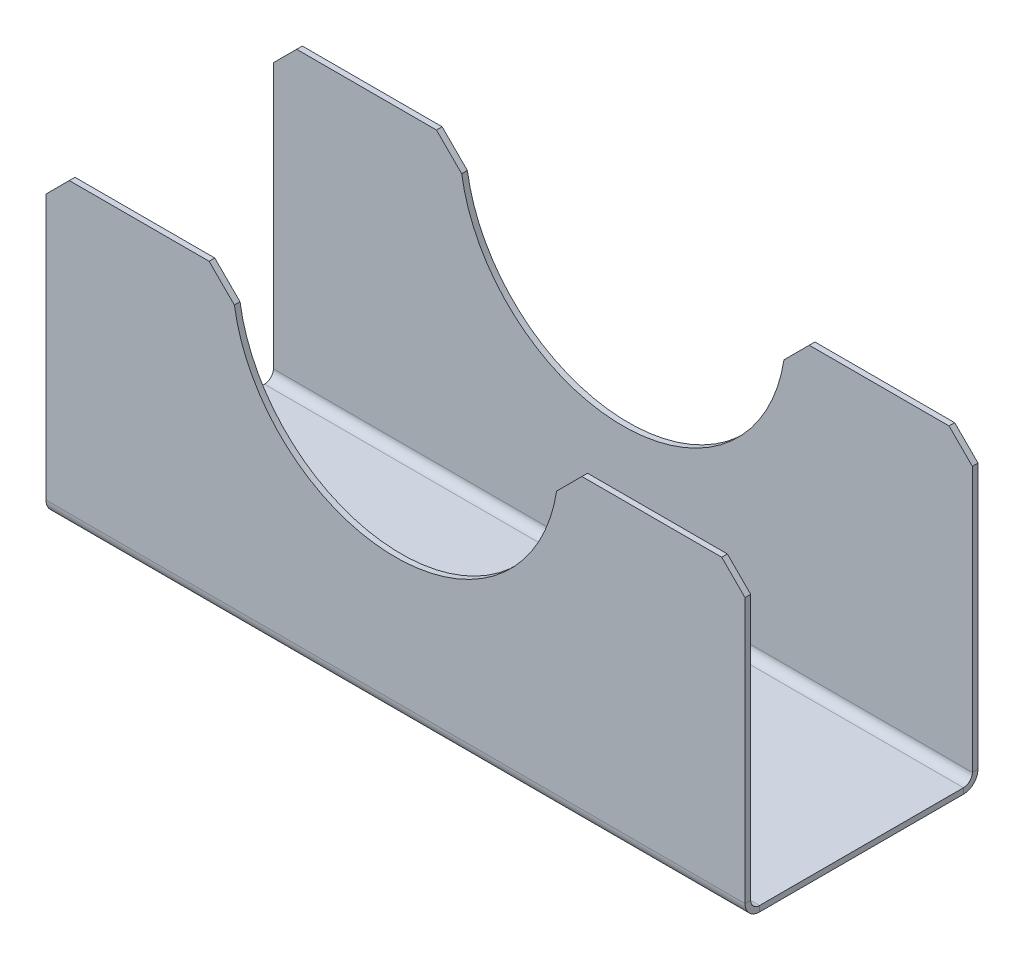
ISO-10303-21;
HEADER;
FILE_DESCRIPTION(('STEP AP214'),'2;1');
FILE_NAME('part.step','',(''),(''),'','','');
FILE_SCHEMA(('AUTOMOTIVE_DESIGN { 1 0 10303 214 1 1 1 1 }'));
ENDSEC;
DATA;
#1=APPLICATION_CONTEXT('core data for automotive mechanical design processes');
#2=APPLICATION_PROTOCOL_DEFINITION('international standard','automotive_design',2000,#1);
#3=PRODUCT_CONTEXT('',#1,'mechanical');
#4=PRODUCT('Part','Part','',(#3));
#5=PRODUCT_RELATED_PRODUCT_CATEGORY('part','',(#4));
#6=PRODUCT_DEFINITION_FORMATION('','',#4);
#7=PRODUCT_DEFINITION_CONTEXT('part definition',#1,'design');
#8=PRODUCT_DEFINITION('design','',#6,#7);
#9=PRODUCT_DEFINITION_SHAPE('','',#8);
#10=(LENGTH_UNIT() NAMED_UNIT(*) SI_UNIT(.MILLI.,.METRE.));
#11=(NAMED_UNIT(*) PLANE_ANGLE_UNIT() SI_UNIT($,.RADIAN.));
#12=(NAMED_UNIT(*) SI_UNIT($,.STERADIAN.) SOLID_ANGLE_UNIT());
#13=UNCERTAINTY_MEASURE_WITH_UNIT(LENGTH_MEASURE(1.E-05),#10,'distance_accuracy_value','');
#14=(GEOMETRIC_REPRESENTATION_CONTEXT(3) GLOBAL_UNCERTAINTY_ASSIGNED_CONTEXT((#13)) GLOBAL_UNIT_ASSIGNED_CONTEXT((#10,
#11,#12)) REPRESENTATION_CONTEXT('',''));
#15=CARTESIAN_POINT('',(0.,0.,0.));
#16=DIRECTION('',(0.,0.,1.));
#17=DIRECTION('',(1.,0.,0.));
#18=AXIS2_PLACEMENT_3D('',#15,#16,#17);
#19=CARTESIAN_POINT('',(75.,-65.,50.));
#20=DIRECTION('',(1.,0.,0.));
#21=DIRECTION('',(0.,0.,-1.));
#22=AXIS2_PLACEMENT_3D('',#19,#20,#21);
#23=PLANE('',#22);
#24=DIRECTION('',(0.,-1.,0.));
#25=VECTOR('',#24,1.);
#26=CARTESIAN_POINT('',(75.,-65.,3.11912));
#27=LINE('',#26,#25);
#28=CARTESIAN_POINT('',(75.,-63.78588,3.11912));
#29=VERTEX_POINT('',#28);
#30=CARTESIAN_POINT('',(75.,-65.,3.11912));
#31=VERTEX_POINT('',#30);
#32=EDGE_CURVE('E11',#29,#31,#27,.T.);
#33=ORIENTED_EDGE('',*,*,#32,.F.);
#34=DIRECTION('',(0.,0.,1.));
#35=VECTOR('',#34,1.);
#36=CARTESIAN_POINT('',(75.,-63.78588,50.));
#37=LINE('',#36,#35);
#38=CARTESIAN_POINT('',(75.,-63.78588,46.88088));
#39=VERTEX_POINT('',#38);
#40=EDGE_CURVE('E127',#39,#29,#37,.F.);
#41=ORIENTED_EDGE('',*,*,#40,.F.);
#42=DIRECTION('',(0.,-1.,0.));
#43=VECTOR('',#42,1.);
#44=CARTESIAN_POINT('',(75.,-65.,46.88088));
#45=LINE('',#44,#43);
#46=CARTESIAN_POINT('',(75.,-65.,46.88088));
#47=VERTEX_POINT('',#46);
#48=EDGE_CURVE('E44',#39,#47,#45,.T.);
#49=ORIENTED_EDGE('',*,*,#48,.T.);
#50=DIRECTION('',(0.,0.,-1.));
#51=VECTOR('',#50,1.);
#52=CARTESIAN_POINT('',(75.,-65.,50.));
#53=LINE('',#52,#51);
#54=EDGE_CURVE('E129',#47,#31,#53,.T.);
#55=ORIENTED_EDGE('',*,*,#54,.T.);
#56=EDGE_LOOP('',(#33,#41,#49,#55));
#57=FACE_BOUND('',#56,.T.);
#58=ADVANCED_FACE('F34',(#57),#23,.T.);
#59=CARTESIAN_POINT('',(75.,-61.88088,46.88088));
#60=DIRECTION('',(1.,0.,0.));
#61=DIRECTION('',(0.,0.,-1.));
#62=AXIS2_PLACEMENT_3D('',#59,#60,#61);
#63=PLANE('',#62);
#64=ORIENTED_EDGE('',*,*,#48,.F.);
#65=CARTESIAN_POINT('',(75.,-61.88088,46.88088));
#66=DIRECTION('',(-1.,0.,0.));
#67=DIRECTION('',(0.,-1.,0.));
#68=AXIS2_PLACEMENT_3D('',#65,#66,#67);
#69=CIRCLE('',#68,1.905);
#70=CARTESIAN_POINT('',(75.,-61.88088,48.78588));
#71=VERTEX_POINT('',#70);
#72=EDGE_CURVE('E168',#39,#71,#69,.T.);
#73=ORIENTED_EDGE('',*,*,#72,.T.);
#74=DIRECTION('',(0.,0.,1.));
#75=VECTOR('',#74,1.);
#76=CARTESIAN_POINT('',(75.,-61.88088,50.));
#77=LINE('',#76,#75);
#78=CARTESIAN_POINT('',(75.,-61.88088,50.));
#79=VERTEX_POINT('',#78);
#80=EDGE_CURVE('E231',#71,#79,#77,.T.);
#81=ORIENTED_EDGE('',*,*,#80,.T.);
#82=CARTESIAN_POINT('',(75.,-61.88088,46.88088));
#83=DIRECTION('',(-1.,0.,0.));
#84=DIRECTION('',(0.,0.,1.));
#85=AXIS2_PLACEMENT_3D('',#82,#83,#84);
#86=CIRCLE('',#85,3.11912);
#87=EDGE_CURVE('E240',#47,#79,#86,.T.);
#88=ORIENTED_EDGE('',*,*,#87,.F.);
#89=EDGE_LOOP('',(#64,#73,#81,#88));
#90=FACE_BOUND('',#89,.T.);
#91=ADVANCED_FACE('F239',(#90),#63,.T.);
#92=CARTESIAN_POINT('',(75.,-65.,50.));
#93=DIRECTION('',(1.,0.,0.));
#94=DIRECTION('',(0.,1.,0.));
#95=AXIS2_PLACEMENT_3D('',#92,#93,#94);
#96=PLANE('',#95);
#97=ORIENTED_EDGE('',*,*,#80,.F.);
#98=DIRECTION('',(0.,1.,0.));
#99=VECTOR('',#98,1.);
#100=CARTESIAN_POINT('',(75.,0.,48.78588));
#101=LINE('',#100,#99);
#102=CARTESIAN_POINT('',(75.,-4.99999999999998,48.78588));
#103=VERTEX_POINT('',#102);
#104=EDGE_CURVE('E165',#71,#103,#101,.T.);
#105=ORIENTED_EDGE('',*,*,#104,.T.);
#106=DIRECTION('',(0.,0.,1.));
#107=VECTOR('',#106,1.);
#108=CARTESIAN_POINT('',(75.,-4.99999999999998,50.));
#109=LINE('',#108,#107);
#110=CARTESIAN_POINT('',(75.,-4.99999999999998,50.));
#111=VERTEX_POINT('',#110);
#112=EDGE_CURVE('E228',#103,#111,#109,.T.);
#113=ORIENTED_EDGE('',*,*,#112,.T.);
#114=DIRECTION('',(0.,1.,0.));
#115=VECTOR('',#114,1.);
#116=CARTESIAN_POINT('',(75.,-65.,50.));
#117=LINE('',#116,#115);
#118=EDGE_CURVE('E259',#79,#111,#117,.T.);
#119=ORIENTED_EDGE('',*,*,#118,.F.);
#120=EDGE_LOOP('',(#97,#105,#113,#119));
#121=FACE_BOUND('',#120,.T.);
#122=ADVANCED_FACE('F260',(#121),#96,.T.);
#123=CARTESIAN_POINT('',(35.0000000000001,35.,50.));
#124=DIRECTION('',(-0.707106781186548,-0.707106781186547,0.));
#125=DIRECTION('',(0.707106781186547,-0.707106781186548,0.));
#126=AXIS2_PLACEMENT_3D('',#123,#124,#125);
#127=PLANE('',#126);
#128=ORIENTED_EDGE('',*,*,#112,.F.);
#129=DIRECTION('',(0.707106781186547,-0.707106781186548,0.));
#130=VECTOR('',#129,1.);
#131=CARTESIAN_POINT('',(35.0000000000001,35.,48.78588));
#132=LINE('',#131,#130);
#133=CARTESIAN_POINT('',(70.0000000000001,0.,48.78588));
#134=VERTEX_POINT('',#133);
#135=EDGE_CURVE('E335',#103,#134,#132,.F.);
#136=ORIENTED_EDGE('',*,*,#135,.T.);
#137=DIRECTION('',(0.,0.,1.));
#138=VECTOR('',#137,1.);
#139=CARTESIAN_POINT('',(70.0000000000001,0.,50.));
#140=LINE('',#139,#138);
#141=CARTESIAN_POINT('',(70.0000000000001,0.,50.));
#142=VERTEX_POINT('',#141);
#143=EDGE_CURVE('E225',#134,#142,#140,.T.);
#144=ORIENTED_EDGE('',*,*,#143,.T.);
#145=DIRECTION('',(0.707106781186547,-0.707106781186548,0.));
#146=VECTOR('',#145,1.);
#147=CARTESIAN_POINT('',(35.0000000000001,35.,50.));
#148=LINE('',#147,#146);
#149=EDGE_CURVE('E264',#111,#142,#148,.F.);
#150=ORIENTED_EDGE('',*,*,#149,.F.);
#151=EDGE_LOOP('',(#128,#136,#144,#150));
#152=FACE_BOUND('',#151,.T.);
#153=ADVANCED_FACE('F348',(#152),#127,.F.);
#154=CARTESIAN_POINT('',(75.,0.,50.));
#155=DIRECTION('',(0.,1.,0.));
#156=DIRECTION('',(-1.,0.,0.));
#157=AXIS2_PLACEMENT_3D('',#154,#155,#156);
#158=PLANE('',#157);
#159=ORIENTED_EDGE('',*,*,#143,.F.);
#160=DIRECTION('',(1.,0.,0.));
#161=VECTOR('',#160,1.);
#162=CARTESIAN_POINT('',(0.,0.,48.78588));
#163=LINE('',#162,#161);
#164=CARTESIAN_POINT('',(40.,0.,48.78588));
#165=VERTEX_POINT('',#164);
#166=EDGE_CURVE('E332',#134,#165,#163,.F.);
#167=ORIENTED_EDGE('',*,*,#166,.T.);
#168=DIRECTION('',(0.,0.,1.));
#169=VECTOR('',#168,1.);
#170=CARTESIAN_POINT('',(40.,0.,50.));
#171=LINE('',#170,#169);
#172=CARTESIAN_POINT('',(40.,0.,50.));
#173=VERTEX_POINT('',#172);
#174=EDGE_CURVE('E222',#165,#173,#171,.T.);
#175=ORIENTED_EDGE('',*,*,#174,.T.);
#176=DIRECTION('',(-1.,0.,0.));
#177=VECTOR('',#176,1.);
#178=CARTESIAN_POINT('',(75.,0.,50.));
#179=LINE('',#178,#177);
#180=EDGE_CURVE('E353',#142,#173,#179,.T.);
#181=ORIENTED_EDGE('',*,*,#180,.F.);
#182=EDGE_LOOP('',(#159,#167,#175,#181));
#183=FACE_BOUND('',#182,.T.);
#184=ADVANCED_FACE('F474',(#183),#158,.T.);
#185=CARTESIAN_POINT('',(19.9999999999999,-20.,50.));
#186=DIRECTION('',(0.707106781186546,-0.707106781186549,0.));
#187=DIRECTION('',(0.707106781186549,0.707106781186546,0.));
#188=AXIS2_PLACEMENT_3D('',#185,#186,#187);
#189=PLANE('',#188);
#190=ORIENTED_EDGE('',*,*,#174,.F.);
#191=DIRECTION('',(0.707106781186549,0.707106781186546,0.));
#192=VECTOR('',#191,1.);
#193=CARTESIAN_POINT('',(19.9999999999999,-20.,48.78588));
#194=LINE('',#193,#192);
#195=CARTESIAN_POINT('',(34.5773797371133,-5.42262026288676,48.78588));
#196=VERTEX_POINT('',#195);
#197=EDGE_CURVE('E329',#165,#196,#194,.F.);
#198=ORIENTED_EDGE('',*,*,#197,.T.);
#199=DIRECTION('',(0.,0.,1.));
#200=VECTOR('',#199,1.);
#201=CARTESIAN_POINT('',(34.5773797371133,-5.42262026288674,50.));
#202=LINE('',#201,#200);
#203=CARTESIAN_POINT('',(34.5773797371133,-5.42262026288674,50.));
#204=VERTEX_POINT('',#203);
#205=EDGE_CURVE('E219',#196,#204,#202,.T.);
#206=ORIENTED_EDGE('',*,*,#205,.T.);
#207=DIRECTION('',(0.707106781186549,0.707106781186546,0.));
#208=VECTOR('',#207,1.);
#209=CARTESIAN_POINT('',(19.9999999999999,-20.,50.));
#210=LINE('',#209,#208);
#211=EDGE_CURVE('E355',#173,#204,#210,.F.);
#212=ORIENTED_EDGE('',*,*,#211,.F.);
#213=EDGE_LOOP('',(#190,#198,#206,#212));
#214=FACE_BOUND('',#213,.T.);
#215=ADVANCED_FACE('F477',(#214),#189,.F.);
#216=CARTESIAN_POINT('',(0.,0.,50.));
#217=DIRECTION('',(0.,0.,1.));
#218=DIRECTION('',(1.,0.,0.));
#219=AXIS2_PLACEMENT_3D('',#216,#217,#218);
#220=CYLINDRICAL_SURFACE('',#219,35.);
#221=ORIENTED_EDGE('',*,*,#205,.F.);
#222=CARTESIAN_POINT('',(0.,0.,48.78588));
#223=DIRECTION('',(0.,0.,-1.));
#224=DIRECTION('',(-1.,0.,0.));
#225=AXIS2_PLACEMENT_3D('',#222,#223,#224);
#226=CIRCLE('',#225,35.);
#227=CARTESIAN_POINT('',(-34.5773797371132,-5.42262026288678,48.78588));
#228=VERTEX_POINT('',#227);
#229=EDGE_CURVE('E326',#196,#228,#226,.T.);
#230=ORIENTED_EDGE('',*,*,#229,.T.);
#231=DIRECTION('',(0.,0.,1.));
#232=VECTOR('',#231,1.);
#233=CARTESIAN_POINT('',(-34.5773797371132,-5.42262026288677,50.));
#234=LINE('',#233,#232);
#235=CARTESIAN_POINT('',(-34.5773797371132,-5.42262026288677,50.));
#236=VERTEX_POINT('',#235);
#237=EDGE_CURVE('E216',#228,#236,#234,.T.);
#238=ORIENTED_EDGE('',*,*,#237,.T.);
#239=CARTESIAN_POINT('',(0.,0.,50.));
#240=DIRECTION('',(0.,0.,-1.));
#241=DIRECTION('',(1.,0.,0.));
#242=AXIS2_PLACEMENT_3D('',#239,#240,#241);
#243=CIRCLE('',#242,35.);
#244=EDGE_CURVE('E360',#204,#236,#243,.T.);
#245=ORIENTED_EDGE('',*,*,#244,.F.);
#246=EDGE_LOOP('',(#221,#230,#238,#245));
#247=FACE_BOUND('',#246,.T.);
#248=ADVANCED_FACE('F481',(#247),#220,.F.);
#249=CARTESIAN_POINT('',(-20.0000000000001,-20.,50.));
#250=DIRECTION('',(-0.70710678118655,-0.707106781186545,0.));
#251=DIRECTION('',(0.707106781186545,-0.70710678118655,0.));
#252=AXIS2_PLACEMENT_3D('',#249,#250,#251);
#253=PLANE('',#252);
#254=ORIENTED_EDGE('',*,*,#237,.F.);
#255=DIRECTION('',(0.707106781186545,-0.70710678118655,0.));
#256=VECTOR('',#255,1.);
#257=CARTESIAN_POINT('',(-20.0000000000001,-20.,48.78588));
#258=LINE('',#257,#256);
#259=CARTESIAN_POINT('',(-40.,0.,48.78588));
#260=VERTEX_POINT('',#259);
#261=EDGE_CURVE('E323',#228,#260,#258,.F.);
#262=ORIENTED_EDGE('',*,*,#261,.T.);
#263=DIRECTION('',(0.,0.,1.));
#264=VECTOR('',#263,1.);
#265=CARTESIAN_POINT('',(-40.,0.,50.));
#266=LINE('',#265,#264);
#267=CARTESIAN_POINT('',(-40.,0.,50.));
#268=VERTEX_POINT('',#267);
#269=EDGE_CURVE('E213',#260,#268,#266,.T.);
#270=ORIENTED_EDGE('',*,*,#269,.T.);
#271=DIRECTION('',(0.707106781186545,-0.70710678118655,0.));
#272=VECTOR('',#271,1.);
#273=CARTESIAN_POINT('',(-20.0000000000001,-20.,50.));
#274=LINE('',#273,#272);
#275=EDGE_CURVE('E363',#236,#268,#274,.F.);
#276=ORIENTED_EDGE('',*,*,#275,.F.);
#277=EDGE_LOOP('',(#254,#262,#270,#276));
#278=FACE_BOUND('',#277,.T.);
#279=ADVANCED_FACE('F485',(#278),#253,.F.);
#280=CARTESIAN_POINT('',(-35.,0.,50.));
#281=DIRECTION('',(0.,1.,0.));
#282=DIRECTION('',(-1.,0.,0.));
#283=AXIS2_PLACEMENT_3D('',#280,#281,#282);
#284=PLANE('',#283);
#285=ORIENTED_EDGE('',*,*,#269,.F.);
#286=DIRECTION('',(1.,0.,0.));
#287=VECTOR('',#286,1.);
#288=CARTESIAN_POINT('',(0.,0.,48.78588));
#289=LINE('',#288,#287);
#290=CARTESIAN_POINT('',(-69.9999999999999,0.,48.78588));
#291=VERTEX_POINT('',#290);
#292=EDGE_CURVE('E320',#260,#291,#289,.F.);
#293=ORIENTED_EDGE('',*,*,#292,.T.);
#294=DIRECTION('',(0.,0.,1.));
#295=VECTOR('',#294,1.);
#296=CARTESIAN_POINT('',(-69.9999999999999,0.,50.));
#297=LINE('',#296,#295);
#298=CARTESIAN_POINT('',(-69.9999999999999,0.,50.));
#299=VERTEX_POINT('',#298);
#300=EDGE_CURVE('E210',#291,#299,#297,.T.);
#301=ORIENTED_EDGE('',*,*,#300,.T.);
#302=DIRECTION('',(-1.,0.,0.));
#303=VECTOR('',#302,1.);
#304=CARTESIAN_POINT('',(-35.,0.,50.));
#305=LINE('',#304,#303);
#306=EDGE_CURVE('E366',#268,#299,#305,.T.);
#307=ORIENTED_EDGE('',*,*,#306,.F.);
#308=EDGE_LOOP('',(#285,#293,#301,#307));
#309=FACE_BOUND('',#308,.T.);
#310=ADVANCED_FACE('F489',(#309),#284,.T.);
#311=CARTESIAN_POINT('',(-35.,35.,50.));
#312=DIRECTION('',(0.707106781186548,-0.707106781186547,0.));
#313=DIRECTION('',(0.707106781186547,0.707106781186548,0.));
#314=AXIS2_PLACEMENT_3D('',#311,#312,#313);
#315=PLANE('',#314);
#316=ORIENTED_EDGE('',*,*,#300,.F.);
#317=DIRECTION('',(0.707106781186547,0.707106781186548,0.));
#318=VECTOR('',#317,1.);
#319=CARTESIAN_POINT('',(-35.,35.,48.78588));
#320=LINE('',#319,#318);
#321=CARTESIAN_POINT('',(-75.,-5.00000000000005,48.78588));
#322=VERTEX_POINT('',#321);
#323=EDGE_CURVE('E317',#291,#322,#320,.F.);
#324=ORIENTED_EDGE('',*,*,#323,.T.);
#325=DIRECTION('',(0.,0.,1.));
#326=VECTOR('',#325,1.);
#327=CARTESIAN_POINT('',(-75.,-5.00000000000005,50.));
#328=LINE('',#327,#326);
#329=CARTESIAN_POINT('',(-75.,-5.00000000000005,50.));
#330=VERTEX_POINT('',#329);
#331=EDGE_CURVE('E207',#322,#330,#328,.T.);
#332=ORIENTED_EDGE('',*,*,#331,.T.);
#333=DIRECTION('',(0.707106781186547,0.707106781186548,0.));
#334=VECTOR('',#333,1.);
#335=CARTESIAN_POINT('',(-35.,35.,50.));
#336=LINE('',#335,#334);
#337=EDGE_CURVE('E369',#299,#330,#336,.F.);
#338=ORIENTED_EDGE('',*,*,#337,.F.);
#339=EDGE_LOOP('',(#316,#324,#332,#338));
#340=FACE_BOUND('',#339,.T.);
#341=ADVANCED_FACE('F493',(#340),#315,.F.);
#342=CARTESIAN_POINT('',(-75.,0.,50.));
#343=DIRECTION('',(-1.,0.,0.));
#344=DIRECTION('',(0.,-1.,0.));
#345=AXIS2_PLACEMENT_3D('',#342,#343,#344);
#346=PLANE('',#345);
#347=ORIENTED_EDGE('',*,*,#331,.F.);
#348=DIRECTION('',(0.,1.,0.));
#349=VECTOR('',#348,1.);
#350=CARTESIAN_POINT('',(-75.,0.,48.78588));
#351=LINE('',#350,#349);
#352=CARTESIAN_POINT('',(-75.,-61.88088,48.78588));
#353=VERTEX_POINT('',#352);
#354=EDGE_CURVE('E158',#322,#353,#351,.F.);
#355=ORIENTED_EDGE('',*,*,#354,.T.);
#356=DIRECTION('',(0.,0.,1.));
#357=VECTOR('',#356,1.);
#358=CARTESIAN_POINT('',(-75.,-61.88088,50.));
#359=LINE('',#358,#357);
#360=CARTESIAN_POINT('',(-75.,-61.88088,50.));
#361=VERTEX_POINT('',#360);
#362=EDGE_CURVE('E204',#353,#361,#359,.T.);
#363=ORIENTED_EDGE('',*,*,#362,.T.);
#364=DIRECTION('',(0.,-1.,0.));
#365=VECTOR('',#364,1.);
#366=CARTESIAN_POINT('',(-75.,0.,50.));
#367=LINE('',#366,#365);
#368=EDGE_CURVE('E271',#330,#361,#367,.T.);
#369=ORIENTED_EDGE('',*,*,#368,.F.);
#370=EDGE_LOOP('',(#347,#355,#363,#369));
#371=FACE_BOUND('',#370,.T.);
#372=ADVANCED_FACE('F448',(#371),#346,.T.);
#373=CARTESIAN_POINT('',(-75.,-61.88088,46.88088));
#374=DIRECTION('',(1.,0.,0.));
#375=DIRECTION('',(0.,1.,0.));
#376=AXIS2_PLACEMENT_3D('',#373,#374,#375);
#377=PLANE('',#376);
#378=ORIENTED_EDGE('',*,*,#362,.F.);
#379=CARTESIAN_POINT('',(-75.,-61.88088,46.88088));
#380=DIRECTION('',(-1.,0.,0.));
#381=DIRECTION('',(0.,-1.,0.));
#382=AXIS2_PLACEMENT_3D('',#379,#380,#381);
#383=CIRCLE('',#382,1.905);
#384=CARTESIAN_POINT('',(-75.,-63.78588,46.88088));
#385=VERTEX_POINT('',#384);
#386=EDGE_CURVE('E163',#353,#385,#383,.F.);
#387=ORIENTED_EDGE('',*,*,#386,.T.);
#388=DIRECTION('',(0.,-1.,0.));
#389=VECTOR('',#388,1.);
#390=CARTESIAN_POINT('',(-75.,-65.,46.88088));
#391=LINE('',#390,#389);
#392=CARTESIAN_POINT('',(-75.,-65.,46.88088));
#393=VERTEX_POINT('',#392);
#394=EDGE_CURVE('E202',#385,#393,#391,.T.);
#395=ORIENTED_EDGE('',*,*,#394,.T.);
#396=CARTESIAN_POINT('',(-75.,-61.88088,46.88088));
#397=DIRECTION('',(-1.,0.,0.));
#398=DIRECTION('',(0.,-1.,0.));
#399=AXIS2_PLACEMENT_3D('',#396,#397,#398);
#400=CIRCLE('',#399,3.11912);
#401=EDGE_CURVE('E256',#361,#393,#400,.F.);
#402=ORIENTED_EDGE('',*,*,#401,.F.);
#403=EDGE_LOOP('',(#378,#387,#395,#402));
#404=FACE_BOUND('',#403,.T.);
#405=ADVANCED_FACE('F450',(#404),#377,.F.);
#406=CARTESIAN_POINT('',(-75.,-65.,50.));
#407=DIRECTION('',(1.,0.,0.));
#408=DIRECTION('',(0.,0.,-1.));
#409=AXIS2_PLACEMENT_3D('',#406,#407,#408);
#410=PLANE('',#409);
#411=ORIENTED_EDGE('',*,*,#394,.F.);
#412=DIRECTION('',(0.,0.,1.));
#413=VECTOR('',#412,1.);
#414=CARTESIAN_POINT('',(-75.,-63.78588,50.));
#415=LINE('',#414,#413);
#416=CARTESIAN_POINT('',(-75.,-63.78588,3.11912));
#417=VERTEX_POINT('',#416);
#418=EDGE_CURVE('E157',#385,#417,#415,.F.);
#419=ORIENTED_EDGE('',*,*,#418,.T.);
#420=DIRECTION('',(0.,-1.,0.));
#421=VECTOR('',#420,1.);
#422=CARTESIAN_POINT('',(-75.,-65.,3.11912));
#423=LINE('',#422,#421);
#424=CARTESIAN_POINT('',(-75.,-65.,3.11912));
#425=VERTEX_POINT('',#424);
#426=EDGE_CURVE('E199',#417,#425,#423,.T.);
#427=ORIENTED_EDGE('',*,*,#426,.T.);
#428=DIRECTION('',(0.,0.,-1.));
#429=VECTOR('',#428,1.);
#430=CARTESIAN_POINT('',(-75.,-65.,50.));
#431=LINE('',#430,#429);
#432=EDGE_CURVE('E373',#393,#425,#431,.T.);
#433=ORIENTED_EDGE('',*,*,#432,.F.);
#434=EDGE_LOOP('',(#411,#419,#427,#433));
#435=FACE_BOUND('',#434,.T.);
#436=ADVANCED_FACE('F453',(#435),#410,.F.);
#437=CARTESIAN_POINT('',(-75.,-61.88088,3.11912));
#438=DIRECTION('',(-1.,0.,0.));
#439=DIRECTION('',(0.,-1.,0.));
#440=AXIS2_PLACEMENT_3D('',#437,#438,#439);
#441=PLANE('',#440);
#442=ORIENTED_EDGE('',*,*,#426,.F.);
#443=CARTESIAN_POINT('',(-75.,-61.88088,3.11912));
#444=DIRECTION('',(1.,0.,0.));
#445=DIRECTION('',(0.,1.,0.));
#446=AXIS2_PLACEMENT_3D('',#443,#444,#445);
#447=CIRCLE('',#446,1.905);
#448=CARTESIAN_POINT('',(-75.,-61.88088,1.21412));
#449=VERTEX_POINT('',#448);
#450=EDGE_CURVE('E145',#417,#449,#447,.T.);
#451=ORIENTED_EDGE('',*,*,#450,.T.);
#452=DIRECTION('',(0.,0.,-1.));
#453=VECTOR('',#452,1.);
#454=CARTESIAN_POINT('',(-75.,-61.88088,0.));
#455=LINE('',#454,#453);
#456=CARTESIAN_POINT('',(-75.,-61.88088,0.));
#457=VERTEX_POINT('',#456);
#458=EDGE_CURVE('E196',#449,#457,#455,.T.);
#459=ORIENTED_EDGE('',*,*,#458,.T.);
#460=CARTESIAN_POINT('',(-75.,-61.88088,3.11912));
#461=DIRECTION('',(1.,0.,0.));
#462=DIRECTION('',(0.,1.,0.));
#463=AXIS2_PLACEMENT_3D('',#460,#461,#462);
#464=CIRCLE('',#463,3.11912);
#465=EDGE_CURVE('E265',#425,#457,#464,.T.);
#466=ORIENTED_EDGE('',*,*,#465,.F.);
#467=EDGE_LOOP('',(#442,#451,#459,#466));
#468=FACE_BOUND('',#467,.T.);
#469=ADVANCED_FACE('F504',(#468),#441,.T.);
#470=CARTESIAN_POINT('',(-75.,0.,0.));
#471=DIRECTION('',(-1.,0.,0.));
#472=DIRECTION('',(0.,-1.,0.));
#473=AXIS2_PLACEMENT_3D('',#470,#471,#472);
#474=PLANE('',#473);
#475=ORIENTED_EDGE('',*,*,#458,.F.);
#476=DIRECTION('',(0.,1.,0.));
#477=VECTOR('',#476,1.);
#478=CARTESIAN_POINT('',(-75.,0.,1.21412));
#479=LINE('',#478,#477);
#480=CARTESIAN_POINT('',(-75.,-5.00000000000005,1.21412));
#481=VERTEX_POINT('',#480);
#482=EDGE_CURVE('E291',#481,#449,#479,.F.);
#483=ORIENTED_EDGE('',*,*,#482,.F.);
#484=DIRECTION('',(0.,0.,-1.));
#485=VECTOR('',#484,1.);
#486=CARTESIAN_POINT('',(-75.,-5.00000000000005,0.));
#487=LINE('',#486,#485);
#488=CARTESIAN_POINT('',(-75.,-5.00000000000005,0.));
#489=VERTEX_POINT('',#488);
#490=EDGE_CURVE('E193',#481,#489,#487,.T.);
#491=ORIENTED_EDGE('',*,*,#490,.T.);
#492=DIRECTION('',(0.,-1.,0.));
#493=VECTOR('',#492,1.);
#494=CARTESIAN_POINT('',(-75.,0.,0.));
#495=LINE('',#494,#493);
#496=EDGE_CURVE('E385',#489,#457,#495,.T.);
#497=ORIENTED_EDGE('',*,*,#496,.T.);
#498=EDGE_LOOP('',(#475,#483,#491,#497));
#499=FACE_BOUND('',#498,.T.);
#500=ADVANCED_FACE('F415',(#499),#474,.T.);
#501=CARTESIAN_POINT('',(-75.,-5.00000000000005,0.));
#502=DIRECTION('',(-0.707106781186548,0.707106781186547,0.));
#503=DIRECTION('',(-0.707106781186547,-0.707106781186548,0.));
#504=AXIS2_PLACEMENT_3D('',#501,#502,#503);
#505=PLANE('',#504);
#506=ORIENTED_EDGE('',*,*,#490,.F.);
#507=DIRECTION('',(-0.707106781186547,-0.707106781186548,0.));
#508=VECTOR('',#507,1.);
#509=CARTESIAN_POINT('',(-75.,-5.00000000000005,1.21412));
#510=LINE('',#509,#508);
#511=CARTESIAN_POINT('',(-69.9999999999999,0.,1.21412));
#512=VERTEX_POINT('',#511);
#513=EDGE_CURVE('E309',#481,#512,#510,.F.);
#514=ORIENTED_EDGE('',*,*,#513,.T.);
#515=DIRECTION('',(0.,0.,-1.));
#516=VECTOR('',#515,1.);
#517=CARTESIAN_POINT('',(-69.9999999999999,0.,0.));
#518=LINE('',#517,#516);
#519=CARTESIAN_POINT('',(-69.9999999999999,0.,0.));
#520=VERTEX_POINT('',#519);
#521=EDGE_CURVE('E190',#512,#520,#518,.T.);
#522=ORIENTED_EDGE('',*,*,#521,.T.);
#523=DIRECTION('',(-0.707106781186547,-0.707106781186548,0.));
#524=VECTOR('',#523,1.);
#525=CARTESIAN_POINT('',(-75.,-5.00000000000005,0.));
#526=LINE('',#525,#524);
#527=EDGE_CURVE('E388',#489,#520,#526,.F.);
#528=ORIENTED_EDGE('',*,*,#527,.F.);
#529=EDGE_LOOP('',(#506,#514,#522,#528));
#530=FACE_BOUND('',#529,.T.);
#531=ADVANCED_FACE('F509',(#530),#505,.T.);
#532=CARTESIAN_POINT('',(-35.,0.,0.));
#533=DIRECTION('',(0.,1.,0.));
#534=DIRECTION('',(-1.,0.,0.));
#535=AXIS2_PLACEMENT_3D('',#532,#533,#534);
#536=PLANE('',#535);
#537=ORIENTED_EDGE('',*,*,#521,.F.);
#538=DIRECTION('',(1.,0.,0.));
#539=VECTOR('',#538,1.);
#540=CARTESIAN_POINT('',(0.,0.,1.21412));
#541=LINE('',#540,#539);
#542=CARTESIAN_POINT('',(-40.,0.,1.21412));
#543=VERTEX_POINT('',#542);
#544=EDGE_CURVE('E306',#543,#512,#541,.F.);
#545=ORIENTED_EDGE('',*,*,#544,.F.);
#546=DIRECTION('',(0.,0.,-1.));
#547=VECTOR('',#546,1.);
#548=CARTESIAN_POINT('',(-40.,0.,0.));
#549=LINE('',#548,#547);
#550=CARTESIAN_POINT('',(-40.,0.,0.));
#551=VERTEX_POINT('',#550);
#552=EDGE_CURVE('E187',#543,#551,#549,.T.);
#553=ORIENTED_EDGE('',*,*,#552,.T.);
#554=DIRECTION('',(-1.,0.,0.));
#555=VECTOR('',#554,1.);
#556=CARTESIAN_POINT('',(-35.,0.,0.));
#557=LINE('',#556,#555);
#558=EDGE_CURVE('E391',#551,#520,#557,.T.);
#559=ORIENTED_EDGE('',*,*,#558,.T.);
#560=EDGE_LOOP('',(#537,#545,#553,#559));
#561=FACE_BOUND('',#560,.T.);
#562=ADVANCED_FACE('F512',(#561),#536,.T.);
#563=CARTESIAN_POINT('',(-40.,0.,0.));
#564=DIRECTION('',(0.70710678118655,0.707106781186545,0.));
#565=DIRECTION('',(-0.707106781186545,0.70710678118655,0.));
#566=AXIS2_PLACEMENT_3D('',#563,#564,#565);
#567=PLANE('',#566);
#568=ORIENTED_EDGE('',*,*,#552,.F.);
#569=DIRECTION('',(-0.707106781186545,0.70710678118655,0.));
#570=VECTOR('',#569,1.);
#571=CARTESIAN_POINT('',(-40.,0.,1.21412));
#572=LINE('',#571,#570);
#573=CARTESIAN_POINT('',(-34.5773797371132,-5.42262026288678,1.21412));
#574=VERTEX_POINT('',#573);
#575=EDGE_CURVE('E303',#543,#574,#572,.F.);
#576=ORIENTED_EDGE('',*,*,#575,.T.);
#577=DIRECTION('',(0.,0.,-1.));
#578=VECTOR('',#577,1.);
#579=CARTESIAN_POINT('',(-34.5773797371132,-5.42262026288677,0.));
#580=LINE('',#579,#578);
#581=CARTESIAN_POINT('',(-34.5773797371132,-5.42262026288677,0.));
#582=VERTEX_POINT('',#581);
#583=EDGE_CURVE('E184',#574,#582,#580,.T.);
#584=ORIENTED_EDGE('',*,*,#583,.T.);
#585=DIRECTION('',(-0.707106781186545,0.70710678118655,0.));
#586=VECTOR('',#585,1.);
#587=CARTESIAN_POINT('',(-40.,0.,0.));
#588=LINE('',#587,#586);
#589=EDGE_CURVE('E394',#551,#582,#588,.F.);
#590=ORIENTED_EDGE('',*,*,#589,.F.);
#591=EDGE_LOOP('',(#568,#576,#584,#590));
#592=FACE_BOUND('',#591,.T.);
#593=ADVANCED_FACE('F516',(#592),#567,.T.);
#594=CARTESIAN_POINT('',(0.,0.,0.));
#595=DIRECTION('',(0.,0.,1.));
#596=DIRECTION('',(1.,0.,0.));
#597=AXIS2_PLACEMENT_3D('',#594,#595,#596);
#598=CYLINDRICAL_SURFACE('',#597,35.);
#599=ORIENTED_EDGE('',*,*,#583,.F.);
#600=CARTESIAN_POINT('',(0.,0.,1.21412));
#601=DIRECTION('',(0.,0.,-1.));
#602=DIRECTION('',(-1.,0.,0.));
#603=AXIS2_PLACEMENT_3D('',#600,#601,#602);
#604=CIRCLE('',#603,35.);
#605=CARTESIAN_POINT('',(34.5773797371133,-5.42262026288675,1.21412));
#606=VERTEX_POINT('',#605);
#607=EDGE_CURVE('E300',#606,#574,#604,.T.);
#608=ORIENTED_EDGE('',*,*,#607,.F.);
#609=DIRECTION('',(0.,0.,-1.));
#610=VECTOR('',#609,1.);
#611=CARTESIAN_POINT('',(34.5773797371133,-5.42262026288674,0.));
#612=LINE('',#611,#610);
#613=CARTESIAN_POINT('',(34.5773797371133,-5.42262026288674,0.));
#614=VERTEX_POINT('',#613);
#615=EDGE_CURVE('E181',#606,#614,#612,.T.);
#616=ORIENTED_EDGE('',*,*,#615,.T.);
#617=CARTESIAN_POINT('',(0.,0.,0.));
#618=DIRECTION('',(0.,0.,-1.));
#619=DIRECTION('',(1.,0.,0.));
#620=AXIS2_PLACEMENT_3D('',#617,#618,#619);
#621=CIRCLE('',#620,35.);
#622=EDGE_CURVE('E397',#614,#582,#621,.T.);
#623=ORIENTED_EDGE('',*,*,#622,.T.);
#624=EDGE_LOOP('',(#599,#608,#616,#623));
#625=FACE_BOUND('',#624,.T.);
#626=ADVANCED_FACE('F520',(#625),#598,.F.);
#627=CARTESIAN_POINT('',(34.5773797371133,-5.42262026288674,0.));
#628=DIRECTION('',(-0.707106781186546,0.707106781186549,0.));
#629=DIRECTION('',(-0.707106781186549,-0.707106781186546,0.));
#630=AXIS2_PLACEMENT_3D('',#627,#628,#629);
#631=PLANE('',#630);
#632=ORIENTED_EDGE('',*,*,#615,.F.);
#633=DIRECTION('',(-0.707106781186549,-0.707106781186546,0.));
#634=VECTOR('',#633,1.);
#635=CARTESIAN_POINT('',(34.5773797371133,-5.42262026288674,1.21412));
#636=LINE('',#635,#634);
#637=CARTESIAN_POINT('',(40.,0.,1.21412));
#638=VERTEX_POINT('',#637);
#639=EDGE_CURVE('E150',#606,#638,#636,.F.);
#640=ORIENTED_EDGE('',*,*,#639,.T.);
#641=DIRECTION('',(0.,0.,-1.));
#642=VECTOR('',#641,1.);
#643=CARTESIAN_POINT('',(40.,0.,0.));
#644=LINE('',#643,#642);
#645=CARTESIAN_POINT('',(40.,0.,0.));
#646=VERTEX_POINT('',#645);
#647=EDGE_CURVE('E178',#638,#646,#644,.T.);
#648=ORIENTED_EDGE('',*,*,#647,.T.);
#649=DIRECTION('',(-0.707106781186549,-0.707106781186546,0.));
#650=VECTOR('',#649,1.);
#651=CARTESIAN_POINT('',(34.5773797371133,-5.42262026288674,0.));
#652=LINE('',#651,#650);
#653=EDGE_CURVE('E400',#614,#646,#652,.F.);
#654=ORIENTED_EDGE('',*,*,#653,.F.);
#655=EDGE_LOOP('',(#632,#640,#648,#654));
#656=FACE_BOUND('',#655,.T.);
#657=ADVANCED_FACE('F524',(#656),#631,.T.);
#658=CARTESIAN_POINT('',(75.,0.,0.));
#659=DIRECTION('',(0.,1.,0.));
#660=DIRECTION('',(-1.,0.,0.));
#661=AXIS2_PLACEMENT_3D('',#658,#659,#660);
#662=PLANE('',#661);
#663=ORIENTED_EDGE('',*,*,#647,.F.);
#664=DIRECTION('',(1.,0.,0.));
#665=VECTOR('',#664,1.);
#666=CARTESIAN_POINT('',(0.,0.,1.21412));
#667=LINE('',#666,#665);
#668=CARTESIAN_POINT('',(70.0000000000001,0.,1.21412));
#669=VERTEX_POINT('',#668);
#670=EDGE_CURVE('E295',#669,#638,#667,.F.);
#671=ORIENTED_EDGE('',*,*,#670,.F.);
#672=DIRECTION('',(0.,0.,-1.));
#673=VECTOR('',#672,1.);
#674=CARTESIAN_POINT('',(70.0000000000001,0.,0.));
#675=LINE('',#674,#673);
#676=CARTESIAN_POINT('',(70.0000000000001,0.,0.));
#677=VERTEX_POINT('',#676);
#678=EDGE_CURVE('E175',#669,#677,#675,.T.);
#679=ORIENTED_EDGE('',*,*,#678,.T.);
#680=DIRECTION('',(-1.,0.,0.));
#681=VECTOR('',#680,1.);
#682=CARTESIAN_POINT('',(75.,0.,0.));
#683=LINE('',#682,#681);
#684=EDGE_CURVE('E376',#677,#646,#683,.T.);
#685=ORIENTED_EDGE('',*,*,#684,.T.);
#686=EDGE_LOOP('',(#663,#671,#679,#685));
#687=FACE_BOUND('',#686,.T.);
#688=ADVANCED_FACE('F528',(#687),#662,.T.);
#689=CARTESIAN_POINT('',(70.0000000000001,0.,0.));
#690=DIRECTION('',(0.707106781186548,0.707106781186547,0.));
#691=DIRECTION('',(-0.707106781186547,0.707106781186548,0.));
#692=AXIS2_PLACEMENT_3D('',#689,#690,#691);
#693=PLANE('',#692);
#694=ORIENTED_EDGE('',*,*,#678,.F.);
#695=DIRECTION('',(-0.707106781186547,0.707106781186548,0.));
#696=VECTOR('',#695,1.);
#697=CARTESIAN_POINT('',(70.0000000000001,0.,1.21412));
#698=LINE('',#697,#696);
#699=CARTESIAN_POINT('',(75.,-4.99999999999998,1.21412));
#700=VERTEX_POINT('',#699);
#701=EDGE_CURVE('E292',#669,#700,#698,.F.);
#702=ORIENTED_EDGE('',*,*,#701,.T.);
#703=DIRECTION('',(0.,0.,-1.));
#704=VECTOR('',#703,1.);
#705=CARTESIAN_POINT('',(75.,-4.99999999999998,0.));
#706=LINE('',#705,#704);
#707=CARTESIAN_POINT('',(75.,-4.99999999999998,0.));
#708=VERTEX_POINT('',#707);
#709=EDGE_CURVE('E172',#700,#708,#706,.T.);
#710=ORIENTED_EDGE('',*,*,#709,.T.);
#711=DIRECTION('',(-0.707106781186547,0.707106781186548,0.));
#712=VECTOR('',#711,1.);
#713=CARTESIAN_POINT('',(70.0000000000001,0.,0.));
#714=LINE('',#713,#712);
#715=EDGE_CURVE('E379',#677,#708,#714,.F.);
#716=ORIENTED_EDGE('',*,*,#715,.F.);
#717=EDGE_LOOP('',(#694,#702,#710,#716));
#718=FACE_BOUND('',#717,.T.);
#719=ADVANCED_FACE('F532',(#718),#693,.T.);
#720=CARTESIAN_POINT('',(75.,-65.,0.));
#721=DIRECTION('',(1.,0.,0.));
#722=DIRECTION('',(0.,1.,0.));
#723=AXIS2_PLACEMENT_3D('',#720,#721,#722);
#724=PLANE('',#723);
#725=ORIENTED_EDGE('',*,*,#709,.F.);
#726=DIRECTION('',(0.,1.,0.));
#727=VECTOR('',#726,1.);
#728=CARTESIAN_POINT('',(75.,0.,1.21412));
#729=LINE('',#728,#727);
#730=CARTESIAN_POINT('',(75.,-61.88088,1.21412));
#731=VERTEX_POINT('',#730);
#732=EDGE_CURVE('E288',#731,#700,#729,.T.);
#733=ORIENTED_EDGE('',*,*,#732,.F.);
#734=DIRECTION('',(0.,0.,-1.));
#735=VECTOR('',#734,1.);
#736=CARTESIAN_POINT('',(75.,-61.88088,0.));
#737=LINE('',#736,#735);
#738=CARTESIAN_POINT('',(75.,-61.88088,0.));
#739=VERTEX_POINT('',#738);
#740=EDGE_CURVE('E38',#731,#739,#737,.T.);
#741=ORIENTED_EDGE('',*,*,#740,.T.);
#742=DIRECTION('',(0.,1.,0.));
#743=VECTOR('',#742,1.);
#744=CARTESIAN_POINT('',(75.,-65.,0.));
#745=LINE('',#744,#743);
#746=EDGE_CURVE('E382',#739,#708,#745,.T.);
#747=ORIENTED_EDGE('',*,*,#746,.T.);
#748=EDGE_LOOP('',(#725,#733,#741,#747));
#749=FACE_BOUND('',#748,.T.);
#750=ADVANCED_FACE('F427',(#749),#724,.T.);
#751=CARTESIAN_POINT('',(75.,-61.88088,3.11912));
#752=DIRECTION('',(-1.,0.,0.));
#753=DIRECTION('',(0.,0.,1.));
#754=AXIS2_PLACEMENT_3D('',#751,#752,#753);
#755=PLANE('',#754);
#756=CARTESIAN_POINT('',(75.,-61.88088,3.11912));
#757=DIRECTION('',(1.,0.,0.));
#758=DIRECTION('',(0.,1.,0.));
#759=AXIS2_PLACEMENT_3D('',#756,#757,#758);
#760=CIRCLE('',#759,1.905);
#761=EDGE_CURVE('E142',#731,#29,#760,.F.);
#762=ORIENTED_EDGE('',*,*,#761,.T.);
#763=ORIENTED_EDGE('',*,*,#32,.T.);
#764=CARTESIAN_POINT('',(75.,-61.88088,3.11912));
#765=DIRECTION('',(1.,0.,0.));
#766=DIRECTION('',(0.,0.,-1.));
#767=AXIS2_PLACEMENT_3D('',#764,#765,#766);
#768=CIRCLE('',#767,3.11912);
#769=EDGE_CURVE('E283',#739,#31,#768,.F.);
#770=ORIENTED_EDGE('',*,*,#769,.F.);
#771=ORIENTED_EDGE('',*,*,#740,.F.);
#772=EDGE_LOOP('',(#762,#763,#770,#771));
#773=FACE_BOUND('',#772,.T.);
#774=ADVANCED_FACE('F36',(#773),#755,.F.);
#775=CARTESIAN_POINT('',(0.,0.,0.));
#776=DIRECTION('',(0.,0.,1.));
#777=DIRECTION('',(1.,0.,0.));
#778=AXIS2_PLACEMENT_3D('',#775,#776,#777);
#779=PLANE('',#778);
#780=ORIENTED_EDGE('',*,*,#746,.F.);
#781=DIRECTION('',(1.,0.,0.));
#782=VECTOR('',#781,1.);
#783=CARTESIAN_POINT('',(0.,-61.88088,0.));
#784=LINE('',#783,#782);
#785=EDGE_CURVE('E273',#739,#457,#784,.F.);
#786=ORIENTED_EDGE('',*,*,#785,.T.);
#787=ORIENTED_EDGE('',*,*,#496,.F.);
#788=ORIENTED_EDGE('',*,*,#527,.T.);
#789=ORIENTED_EDGE('',*,*,#558,.F.);
#790=ORIENTED_EDGE('',*,*,#589,.T.);
#791=ORIENTED_EDGE('',*,*,#622,.F.);
#792=ORIENTED_EDGE('',*,*,#653,.T.);
#793=ORIENTED_EDGE('',*,*,#684,.F.);
#794=ORIENTED_EDGE('',*,*,#715,.T.);
#795=EDGE_LOOP('',(#780,#786,#787,#788,#789,#790,#791,#792,#793,#794));
#796=FACE_BOUND('',#795,.T.);
#797=ADVANCED_FACE('F421',(#796),#779,.F.);
#798=CARTESIAN_POINT('',(-75.,-65.,50.));
#799=DIRECTION('',(0.,1.,0.));
#800=DIRECTION('',(-1.,0.,0.));
#801=AXIS2_PLACEMENT_3D('',#798,#799,#800);
#802=PLANE('',#801);
#803=ORIENTED_EDGE('',*,*,#54,.F.);
#804=DIRECTION('',(1.,0.,0.));
#805=VECTOR('',#804,1.);
#806=CARTESIAN_POINT('',(-75.,-65.,46.88088));
#807=LINE('',#806,#805);
#808=EDGE_CURVE('E255',#47,#393,#807,.F.);
#809=ORIENTED_EDGE('',*,*,#808,.T.);
#810=ORIENTED_EDGE('',*,*,#432,.T.);
#811=DIRECTION('',(1.,0.,0.));
#812=VECTOR('',#811,1.);
#813=CARTESIAN_POINT('',(-75.,-65.,3.11912));
#814=LINE('',#813,#812);
#815=EDGE_CURVE('E277',#425,#31,#814,.T.);
#816=ORIENTED_EDGE('',*,*,#815,.T.);
#817=EDGE_LOOP('',(#803,#809,#810,#816));
#818=FACE_BOUND('',#817,.T.);
#819=ADVANCED_FACE('F455',(#818),#802,.F.);
#820=CARTESIAN_POINT('',(0.,0.,50.));
#821=DIRECTION('',(0.,0.,1.));
#822=DIRECTION('',(1.,0.,0.));
#823=AXIS2_PLACEMENT_3D('',#820,#821,#822);
#824=PLANE('',#823);
#825=ORIENTED_EDGE('',*,*,#368,.T.);
#826=DIRECTION('',(1.,0.,0.));
#827=VECTOR('',#826,1.);
#828=CARTESIAN_POINT('',(75.,-61.88088,50.));
#829=LINE('',#828,#827);
#830=EDGE_CURVE('E253',#361,#79,#829,.T.);
#831=ORIENTED_EDGE('',*,*,#830,.T.);
#832=ORIENTED_EDGE('',*,*,#118,.T.);
#833=ORIENTED_EDGE('',*,*,#149,.T.);
#834=ORIENTED_EDGE('',*,*,#180,.T.);
#835=ORIENTED_EDGE('',*,*,#211,.T.);
#836=ORIENTED_EDGE('',*,*,#244,.T.);
#837=ORIENTED_EDGE('',*,*,#275,.T.);
#838=ORIENTED_EDGE('',*,*,#306,.T.);
#839=ORIENTED_EDGE('',*,*,#337,.T.);
#840=EDGE_LOOP('',(#825,#831,#832,#833,#834,#835,#836,#837,#838,#839));
#841=FACE_BOUND('',#840,.T.);
#842=ADVANCED_FACE('F268',(#841),#824,.T.);
#843=CARTESIAN_POINT('',(-75.,-61.88088,3.11912));
#844=DIRECTION('',(1.,0.,0.));
#845=DIRECTION('',(0.,1.,0.));
#846=AXIS2_PLACEMENT_3D('',#843,#844,#845);
#847=CYLINDRICAL_SURFACE('',#846,3.11912);
#848=ORIENTED_EDGE('',*,*,#465,.T.);
#849=ORIENTED_EDGE('',*,*,#785,.F.);
#850=ORIENTED_EDGE('',*,*,#769,.T.);
#851=ORIENTED_EDGE('',*,*,#815,.F.);
#852=EDGE_LOOP('',(#848,#849,#850,#851));
#853=FACE_BOUND('',#852,.T.);
#854=ADVANCED_FACE('F408',(#853),#847,.T.);
#855=CARTESIAN_POINT('',(0.,-61.88088,46.88088));
#856=DIRECTION('',(-1.,0.,0.));
#857=DIRECTION('',(0.,-1.,0.));
#858=AXIS2_PLACEMENT_3D('',#855,#856,#857);
#859=CYLINDRICAL_SURFACE('',#858,3.11912);
#860=ORIENTED_EDGE('',*,*,#401,.T.);
#861=ORIENTED_EDGE('',*,*,#808,.F.);
#862=ORIENTED_EDGE('',*,*,#87,.T.);
#863=ORIENTED_EDGE('',*,*,#830,.F.);
#864=EDGE_LOOP('',(#860,#861,#862,#863));
#865=FACE_BOUND('',#864,.T.);
#866=ADVANCED_FACE('F251',(#865),#859,.T.);
#867=CARTESIAN_POINT('',(0.,0.,1.21412));
#868=DIRECTION('',(0.,0.,1.));
#869=DIRECTION('',(1.,0.,0.));
#870=AXIS2_PLACEMENT_3D('',#867,#868,#869);
#871=PLANE('',#870);
#872=ORIENTED_EDGE('',*,*,#732,.T.);
#873=ORIENTED_EDGE('',*,*,#701,.F.);
#874=ORIENTED_EDGE('',*,*,#670,.T.);
#875=ORIENTED_EDGE('',*,*,#639,.F.);
#876=ORIENTED_EDGE('',*,*,#607,.T.);
#877=ORIENTED_EDGE('',*,*,#575,.F.);
#878=ORIENTED_EDGE('',*,*,#544,.T.);
#879=ORIENTED_EDGE('',*,*,#513,.F.);
#880=ORIENTED_EDGE('',*,*,#482,.T.);
#881=DIRECTION('',(1.,0.,0.));
#882=VECTOR('',#881,1.);
#883=CARTESIAN_POINT('',(0.,-61.88088,1.21412));
#884=LINE('',#883,#882);
#885=EDGE_CURVE('E149',#731,#449,#884,.F.);
#886=ORIENTED_EDGE('',*,*,#885,.F.);
#887=EDGE_LOOP('',(#872,#873,#874,#875,#876,#877,#878,#879,#880,#886));
#888=FACE_BOUND('',#887,.T.);
#889=ADVANCED_FACE('F548',(#888),#871,.T.);
#890=CARTESIAN_POINT('',(-75.,-63.78588,50.));
#891=DIRECTION('',(0.,1.,0.));
#892=DIRECTION('',(-1.,0.,0.));
#893=AXIS2_PLACEMENT_3D('',#890,#891,#892);
#894=PLANE('',#893);
#895=ORIENTED_EDGE('',*,*,#40,.T.);
#896=DIRECTION('',(-1.,0.,0.));
#897=VECTOR('',#896,1.);
#898=CARTESIAN_POINT('',(-75.,-63.78588,3.11912));
#899=LINE('',#898,#897);
#900=EDGE_CURVE('E139',#417,#29,#899,.F.);
#901=ORIENTED_EDGE('',*,*,#900,.F.);
#902=ORIENTED_EDGE('',*,*,#418,.F.);
#903=DIRECTION('',(-1.,0.,0.));
#904=VECTOR('',#903,1.);
#905=CARTESIAN_POINT('',(-75.,-63.78588,46.88088));
#906=LINE('',#905,#904);
#907=EDGE_CURVE('E155',#39,#385,#906,.T.);
#908=ORIENTED_EDGE('',*,*,#907,.F.);
#909=EDGE_LOOP('',(#895,#901,#902,#908));
#910=FACE_BOUND('',#909,.T.);
#911=ADVANCED_FACE('F153',(#910),#894,.T.);
#912=CARTESIAN_POINT('',(0.,0.,48.78588));
#913=DIRECTION('',(0.,0.,1.));
#914=DIRECTION('',(1.,0.,0.));
#915=AXIS2_PLACEMENT_3D('',#912,#913,#914);
#916=PLANE('',#915);
#917=ORIENTED_EDGE('',*,*,#354,.F.);
#918=ORIENTED_EDGE('',*,*,#323,.F.);
#919=ORIENTED_EDGE('',*,*,#292,.F.);
#920=ORIENTED_EDGE('',*,*,#261,.F.);
#921=ORIENTED_EDGE('',*,*,#229,.F.);
#922=ORIENTED_EDGE('',*,*,#197,.F.);
#923=ORIENTED_EDGE('',*,*,#166,.F.);
#924=ORIENTED_EDGE('',*,*,#135,.F.);
#925=ORIENTED_EDGE('',*,*,#104,.F.);
#926=DIRECTION('',(1.,0.,0.));
#927=VECTOR('',#926,1.);
#928=CARTESIAN_POINT('',(0.,-61.88088,48.78588));
#929=LINE('',#928,#927);
#930=EDGE_CURVE('E284',#353,#71,#929,.T.);
#931=ORIENTED_EDGE('',*,*,#930,.F.);
#932=EDGE_LOOP('',(#917,#918,#919,#920,#921,#922,#923,#924,#925,#931));
#933=FACE_BOUND('',#932,.T.);
#934=ADVANCED_FACE('F343',(#933),#916,.F.);
#935=CARTESIAN_POINT('',(-75.,-61.88088,3.11912));
#936=DIRECTION('',(1.,0.,0.));
#937=DIRECTION('',(0.,1.,0.));
#938=AXIS2_PLACEMENT_3D('',#935,#936,#937);
#939=CYLINDRICAL_SURFACE('',#938,1.905);
#940=ORIENTED_EDGE('',*,*,#450,.F.);
#941=ORIENTED_EDGE('',*,*,#900,.T.);
#942=ORIENTED_EDGE('',*,*,#761,.F.);
#943=ORIENTED_EDGE('',*,*,#885,.T.);
#944=EDGE_LOOP('',(#940,#941,#942,#943));
#945=FACE_BOUND('',#944,.T.);
#946=ADVANCED_FACE('F140',(#945),#939,.F.);
#947=CARTESIAN_POINT('',(0.,-61.88088,46.88088));
#948=DIRECTION('',(-1.,0.,0.));
#949=DIRECTION('',(0.,-1.,0.));
#950=AXIS2_PLACEMENT_3D('',#947,#948,#949);
#951=CYLINDRICAL_SURFACE('',#950,1.905);
#952=ORIENTED_EDGE('',*,*,#386,.F.);
#953=ORIENTED_EDGE('',*,*,#930,.T.);
#954=ORIENTED_EDGE('',*,*,#72,.F.);
#955=ORIENTED_EDGE('',*,*,#907,.T.);
#956=EDGE_LOOP('',(#952,#953,#954,#955));
#957=FACE_BOUND('',#956,.T.);
#958=ADVANCED_FACE('F538',(#957),#951,.F.);
#959=CLOSED_SHELL('',(#58,#91,#122,#153,#184,#215,#248,#279,#310,#341,#372,#405,#436,#469,#500,
#531,#562,#593,#626,#657,#688,#719,#750,#774,#797,#819,#842,#854,#866,#889,#911,#934,#946,#958));
#960=MANIFOLD_SOLID_BREP('B2',#959);
#961=ADVANCED_BREP_SHAPE_REPRESENTATION('',(#18,#960),#14);
#962=SHAPE_DEFINITION_REPRESENTATION(#9,#961);
ENDSEC;
END-ISO-10303-21;
